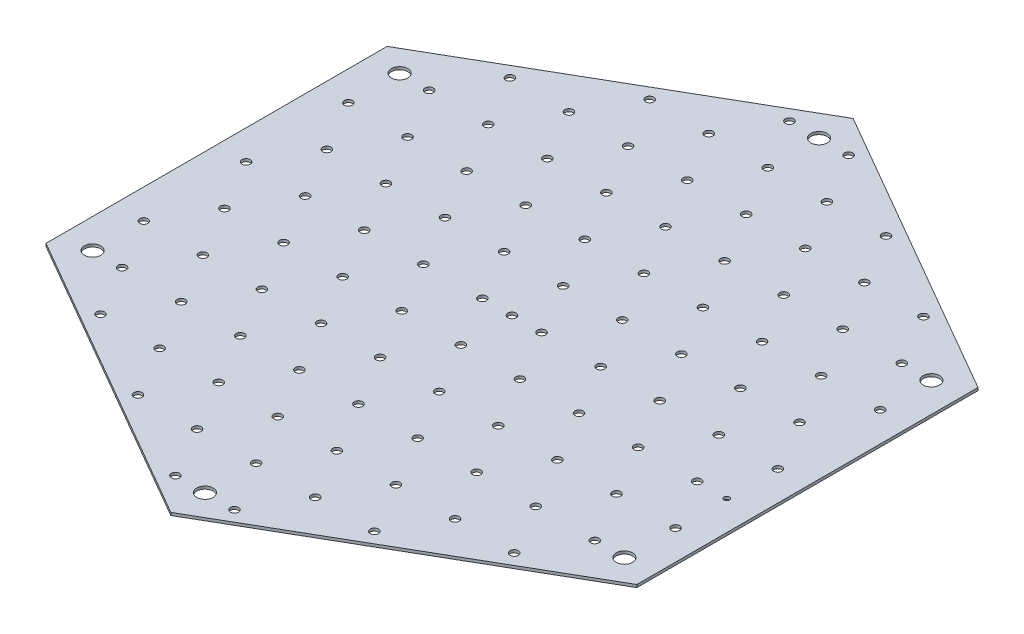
from build123d import *

# Parameters (mm, degrees)
BOSS_EXTRUDE1_DEPTH   = 0.5
SKETCH2_R             = 0.75
CUT_EXTRUDE1_DEPTH    = 83.681240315
BOSS_EXTRUDE2_DEPTH   = 0.5
BOSS_EXTRUDE3_DEPTH   = 0.5
BOSS_EXTRUDE4_DEPTH   = 0.5
SKETCH4_R             = 1.5
CUT_EXTRUDE3_DEPTH    = 83.681240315
SKETCH8_R             = 0.75
CUT_EXTRUDE4_DEPTH    = 83.681240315
SKETCH9_R             = 0.75
CUT_EXTRUDE5_DEPTH    = 83.681240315
SKETCH10_R            = 0.75
CUT_EXTRUDE6_DEPTH    = 83.681240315
SKETCH11_R            = 0.75
CUT_EXTRUDE7_DEPTH    = 83.681240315
SKETCH12_R            = 0.75
CUT_EXTRUDE8_DEPTH    = 83.681240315
SKETCH13_R            = 0.75
CUT_EXTRUDE9_DEPTH    = 83.681240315
SKETCH14_R            = 0.75
CUT_EXTRUDE10_DEPTH   = 83.681240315
SKETCH15_R            = 0.75
CUT_EXTRUDE11_DEPTH   = 83.681240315
SKETCH16_R            = 0.75
CUT_EXTRUDE12_DEPTH   = 83.681240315
SKETCH17_R            = 0.75
CUT_EXTRUDE13_DEPTH   = 83.681240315
LPATTERN3_COUNT       = 5
LPATTERN3_PITCH       = 10.8253
LPATTERN3_COL_COUNT   = 6
LPATTERN3_COL_PITCH   = 10.8253
LPATTERN4_COUNT       = 6
LPATTERN4_PITCH       = 10.8253
LPATTERN4_COL_COUNT   = 5
LPATTERN4_COL_PITCH   = 10.8253
LPATTERN5_COUNT       = 4
LPATTERN5_PITCH       = 10.8253
LPATTERN5_COL_COUNT   = 7
LPATTERN5_COL_PITCH   = 10.8253
LPATTERN6_COUNT       = 3
LPATTERN6_PITCH       = 10.8253
LPATTERN6_COL_COUNT   = 7
LPATTERN6_COL_PITCH   = 10.8253
LPATTERN7_COUNT       = 6
LPATTERN7_PITCH       = 10.8253
LPATTERN8_COUNT       = 5
LPATTERN8_PITCH       = 10.8253
LPATTERN9_COUNT       = 5
LPATTERN9_PITCH       = 10.8253
LPATTERN9_COL_COUNT   = 2
LPATTERN9_COL_PITCH   = 10.8253
LPATTERN10_COUNT      = 4
LPATTERN10_PITCH      = 10.8253
LPATTERN10_COL_COUNT  = 3
LPATTERN10_COL_PITCH  = 10.8253
LPATTERN11_COUNT      = 4
LPATTERN11_PITCH      = 10.8253
LPATTERN11_COL_COUNT  = 3
LPATTERN11_COL_PITCH  = 10.8253
LPATTERN12_COUNT      = 5
LPATTERN12_PITCH      = 10.8253
LPATTERN13_COUNT      = 6
LPATTERN13_PITCH      = 10.8253
LPATTERN14_COUNT      = 6
LPATTERN14_PITCH      = 10.8253
LPATTERN14_COUNT_DIR2 = 5
LPATTERN14_PITCH_DIR2 = 10.8253
LPATTERN15_COUNT      = 7
LPATTERN15_PITCH      = 10.8253
LPATTERN15_COUNT_DIR2 = 4
LPATTERN15_PITCH_DIR2 = 10.8253
LPATTERN16_COUNT      = 7
LPATTERN16_PITCH      = 10.8253
LPATTERN16_COUNT_DIR2 = 3
LPATTERN16_PITCH_DIR2 = 10.8253
LPATTERN17_COUNT      = 6
LPATTERN17_PITCH      = 10.8253
LPATTERN18_COUNT      = 5
LPATTERN18_PITCH      = 10.8253
LPATTERN19_COUNT      = 4
LPATTERN19_PITCH      = 10.8253
LPATTERN20_COUNT      = 3
LPATTERN20_PITCH      = 10.8253
SKETCH18_R            = 0.5
CUT_EXTRUDE14_DEPTH   = 83.681240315


with BuildPart() as part:
    # Sketch1 → Boss-Extrude1 (new body)
    with BuildSketch(Plane(origin=(0, 0, 0), x_dir=(1, 0, 0), z_dir=(0, 1, 0))):
        Polygon((0, 62.5), (-54.126587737, 31.25), (-54.126587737, -31.25), (0, -62.5), (54.126587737, -31.25), (54.126587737, 31.25), align=None)
    extrude(amount=BOSS_EXTRUDE1_DEPTH)

    # Sketch2 → Cut-Extrude1 (cut, through all)
    with BuildSketch(Plane(origin=(0, 0.5, 0), x_dir=(1, 0, 0), z_dir=(0, 1, 0))):
        with Locations(Location((0, 0, 0), (0, 0, 270))):
            Circle(SKETCH2_R)
    extrude(amount=-CUT_EXTRUDE1_DEPTH, mode=Mode.SUBTRACT)

    # Sketch5 → Boss-Extrude2 (add)
    with BuildSketch(Plane(origin=(0, 0.5, 0), x_dir=(1, 0, 0), z_dir=(0, 1, 0))):
        Polygon((-54.126587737, 26.862137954), (3.8, 60.306068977), (0, 62.5), (-54.126587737, 31.25), align=None)
    extrude(amount=-BOSS_EXTRUDE2_DEPTH)

    # Sketch6 → Boss-Extrude3 (add)
    with BuildSketch(Plane(origin=(0, 0.5, 0), x_dir=(1, 0, 0), z_dir=(0, 1, 0))):
        Polygon((54.126587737, 31.25), (54.126587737, 26.862137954), (-3.8, 60.306068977), (0, 62.5), align=None)
    extrude(amount=-BOSS_EXTRUDE3_DEPTH)

    # Sketch7 → Boss-Extrude4 (add)
    with BuildSketch(Plane(origin=(0, 0.5, 0), x_dir=(1, 0, 0), z_dir=(0, 1, 0))):
        Polygon((-54.126587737, -31.25), (-54.126587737, -26.862137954), (0, -58.112137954), (54.126587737, -26.862137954), (54.126587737, -31.25), (0, -62.5), align=None)
    extrude(amount=-BOSS_EXTRUDE4_DEPTH)

    # Sketch4 → Cut-Extrude3 (cut, through all)
    with BuildSketch(Plane(origin=(0, 0.5, 0), x_dir=(1, 0, 0), z_dir=(0, 1, 0))):
        with Locations(Location((0, 56.253070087, 0), (0, 0, 270))):
            Circle(SKETCH4_R)
        with Locations(Location((-48.713928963, 28.125, 0), (0, 0, 270))):
            Circle(SKETCH4_R)
        with Locations(Location((-48.716587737, -28.126535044, 0), (0, 0, 270))):
            Circle(SKETCH4_R)
        with Locations(Location((0, -56.253070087, 0), (0, 0, 270))):
            Circle(SKETCH4_R)
        with Locations(Location((48.716587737, -28.126535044, 0), (0, 0, 270))):
            Circle(SKETCH4_R)
        with Locations(Location((48.716587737, 28.126535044, 0), (0, 0, 270))):
            Circle(SKETCH4_R)
    extrude(amount=-CUT_EXTRUDE3_DEPTH, mode=Mode.SUBTRACT)

    # Sketch8 → Cut-Extrude4 (cut, through all)
    with BuildSketch(Plane(origin=(0, 0.5, 0), x_dir=(1, 0, 0), z_dir=(0, 1, 0))):
        with Locations(Location((5.41265, 0, 0), (0, 0, 270))):
            Circle(SKETCH8_R)
    cut_extrude4 = extrude(amount=-CUT_EXTRUDE4_DEPTH, mode=Mode.SUBTRACT)

    # Sketch9 → Cut-Extrude5 (cut, through all)
    with BuildSketch(Plane(origin=(0, 0.5, 0), x_dir=(1, 0, 0), z_dir=(0, 1, 0))):
        with Locations(Location((16.23795, 0, 0), (0, 0, 270))):
            Circle(SKETCH9_R)
    cut_extrude5 = extrude(amount=-CUT_EXTRUDE5_DEPTH, mode=Mode.SUBTRACT)

    # Sketch10 → Cut-Extrude6 (cut, through all)
    with BuildSketch(Plane(origin=(0, 0.5, 0), x_dir=(1, 0, 0), z_dir=(0, 1, 0))):
        with Locations(Location((27.06325, 0, 0), (0, 0, 270))):
            Circle(SKETCH10_R)
    cut_extrude6 = extrude(amount=-CUT_EXTRUDE6_DEPTH, mode=Mode.SUBTRACT)

    # Sketch11 → Cut-Extrude7 (cut, through all)
    with BuildSketch(Plane(origin=(0, 0.5, 0), x_dir=(1, 0, 0), z_dir=(0, 1, 0))):
        with Locations(Location((37.88855, 0, 0), (0, 0, 270))):
            Circle(SKETCH11_R)
    cut_extrude7 = extrude(amount=-CUT_EXTRUDE7_DEPTH, mode=Mode.SUBTRACT)

    # Sketch12 → Cut-Extrude8 (cut, through all)
    with BuildSketch(Plane(origin=(0, 0.5, 0), x_dir=(1, 0, 0), z_dir=(0, 1, 0))):
        with Locations(Location((48.71385, 0, 0), (0, 0, 270))):
            Circle(SKETCH12_R)
    cut_extrude8 = extrude(amount=-CUT_EXTRUDE8_DEPTH, mode=Mode.SUBTRACT)

    # Sketch13 → Cut-Extrude9 (cut, through all)
    with BuildSketch(Plane(origin=(0, 0.5, 0), x_dir=(1, 0, 0), z_dir=(0, 1, 0))):
        with Locations(Location((-5.41265, 0, 0), (0, 0, 270))):
            Circle(SKETCH13_R)
    cut_extrude9 = extrude(amount=-CUT_EXTRUDE9_DEPTH, mode=Mode.SUBTRACT)

    # Sketch14 → Cut-Extrude10 (cut, through all)
    with BuildSketch(Plane(origin=(0, 0.5, 0), x_dir=(1, 0, 0), z_dir=(0, 1, 0))):
        with Locations(Location((-16.23795, 0, 0), (0, 0, 270))):
            Circle(SKETCH14_R)
    cut_extrude10 = extrude(amount=-CUT_EXTRUDE10_DEPTH, mode=Mode.SUBTRACT)

    # Sketch15 → Cut-Extrude11 (cut, through all)
    with BuildSketch(Plane(origin=(0, 0.5, 0), x_dir=(1, 0, 0), z_dir=(0, 1, 0))):
        with Locations(Location((-27.06325, 0, 0), (0, 0, 270))):
            Circle(SKETCH15_R)
    cut_extrude11 = extrude(amount=-CUT_EXTRUDE11_DEPTH, mode=Mode.SUBTRACT)

    # Sketch16 → Cut-Extrude12 (cut, through all)
    with BuildSketch(Plane(origin=(0, 0.5, 0), x_dir=(1, 0, 0), z_dir=(0, 1, 0))):
        with Locations(Location((-37.88855, 0, 0), (0, 0, 270))):
            Circle(SKETCH16_R)
    cut_extrude12 = extrude(amount=-CUT_EXTRUDE12_DEPTH, mode=Mode.SUBTRACT)

    # Sketch17 → Cut-Extrude13 (cut, through all)
    with BuildSketch(Plane(origin=(0, 0.5, 0), x_dir=(1, 0, 0), z_dir=(0, 1, 0))):
        with Locations(Location((-48.71385, 0, 0), (0, 0, 270))):
            Circle(SKETCH17_R)
    cut_extrude13 = extrude(amount=-CUT_EXTRUDE13_DEPTH, mode=Mode.SUBTRACT)

    # LPattern3: Cut-Extrude4 ×5
    with Locations(*[Vector(0.4999999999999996, 0, 0.8660254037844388) * (i * LPATTERN3_PITCH) for i in range(1, LPATTERN3_COUNT)]):
        add(cut_extrude4, mode=Mode.SUBTRACT)

    # LPattern3 col: Cut-Extrude4 ×6
    with Locations(*[Vector(-0.4999999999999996, 0, -0.8660254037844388) * (i * LPATTERN3_COL_PITCH) for i in range(1, LPATTERN3_COL_COUNT)]):
        add(cut_extrude4, mode=Mode.SUBTRACT)

    # LPattern4: Cut-Extrude5 ×6
    with Locations(*[Vector(-0.4999999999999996, 0, -0.8660254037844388) * (i * LPATTERN4_PITCH) for i in range(1, LPATTERN4_COUNT)]):
        add(cut_extrude5, mode=Mode.SUBTRACT)

    # LPattern4 col: Cut-Extrude5 ×5
    with Locations(*[Vector(0.4999999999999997, 0, 0.8660254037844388) * (i * LPATTERN4_COL_PITCH) for i in range(1, LPATTERN4_COL_COUNT)]):
        add(cut_extrude5, mode=Mode.SUBTRACT)

    # LPattern5: Cut-Extrude6 ×4
    with Locations(*[Vector(0.4999999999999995, 0, 0.8660254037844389) * (i * LPATTERN5_PITCH) for i in range(1, LPATTERN5_COUNT)]):
        add(cut_extrude6, mode=Mode.SUBTRACT)

    # LPattern5 col: Cut-Extrude6 ×7
    with Locations(*[Vector(-0.4999999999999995, 0, -0.8660254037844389) * (i * LPATTERN5_COL_PITCH) for i in range(1, LPATTERN5_COL_COUNT)]):
        add(cut_extrude6, mode=Mode.SUBTRACT)

    # LPattern6: Cut-Extrude7 ×3
    with Locations(*[Vector(0.4999999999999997, 0, 0.8660254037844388) * (i * LPATTERN6_PITCH) for i in range(1, LPATTERN6_COUNT)]):
        add(cut_extrude7, mode=Mode.SUBTRACT)

    # LPattern6 col: Cut-Extrude7 ×7
    with Locations(*[Vector(-0.4999999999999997, 0, -0.8660254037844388) * (i * LPATTERN6_COL_PITCH) for i in range(1, LPATTERN6_COL_COUNT)]):
        add(cut_extrude7, mode=Mode.SUBTRACT)

    # LPattern7: Cut-Extrude8 ×6
    with Locations(*[Vector(-0.4999999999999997, 0, -0.8660254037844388) * (i * LPATTERN7_PITCH) for i in range(1, LPATTERN7_COUNT)]):
        add(cut_extrude8, mode=Mode.SUBTRACT)

    # LPattern8: Cut-Extrude9 ×5
    with Locations(*[Vector(-0.4999999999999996, 0, 0.8660254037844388) * (i * LPATTERN8_PITCH) for i in range(1, LPATTERN8_COUNT)]):
        add(cut_extrude9, mode=Mode.SUBTRACT)

    # LPattern9: Cut-Extrude10 ×5
    with Locations(*[Vector(-0.4999999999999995, 0, 0.8660254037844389) * (i * LPATTERN9_PITCH) for i in range(1, LPATTERN9_COUNT)]):
        add(cut_extrude10, mode=Mode.SUBTRACT)

    # LPattern9 col: Cut-Extrude10 ×2
    with Locations(*[Vector(0.4999999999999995, 0, -0.8660254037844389) * (i * LPATTERN9_COL_PITCH) for i in range(1, LPATTERN9_COL_COUNT)]):
        add(cut_extrude10, mode=Mode.SUBTRACT)

    # LPattern10: Cut-Extrude11 ×4
    with Locations(*[Vector(-0.4999999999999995, 0, 0.8660254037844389) * (i * LPATTERN10_PITCH) for i in range(1, LPATTERN10_COUNT)]):
        add(cut_extrude11, mode=Mode.SUBTRACT)

    # LPattern10 col: Cut-Extrude11 ×3
    with Locations(*[Vector(0.4999999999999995, 0, -0.8660254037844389) * (i * LPATTERN10_COL_PITCH) for i in range(1, LPATTERN10_COL_COUNT)]):
        add(cut_extrude11, mode=Mode.SUBTRACT)

    # LPattern11: Cut-Extrude12 ×4
    with Locations(*[Vector(0.4999999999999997, 0, -0.8660254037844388) * (i * LPATTERN11_PITCH) for i in range(1, LPATTERN11_COUNT)]):
        add(cut_extrude12, mode=Mode.SUBTRACT)

    # LPattern11 col: Cut-Extrude12 ×3
    with Locations(*[Vector(-0.4999999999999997, 0, 0.8660254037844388) * (i * LPATTERN11_COL_PITCH) for i in range(1, LPATTERN11_COL_COUNT)]):
        add(cut_extrude12, mode=Mode.SUBTRACT)

    # LPattern12: Cut-Extrude13 ×5
    with Locations(*[Vector(0.4999999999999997, 0, -0.8660254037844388) * (i * LPATTERN12_PITCH) for i in range(1, LPATTERN12_COUNT)]):
        add(cut_extrude13, mode=Mode.SUBTRACT)

    # LPattern13: Cut-Extrude9 ×6
    with Locations(*[Vector(0.4999999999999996, 0, 0.8660254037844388) * (i * LPATTERN13_PITCH) for i in range(1, LPATTERN13_COUNT)]):
        add(cut_extrude9, mode=Mode.SUBTRACT)

    # LPattern14: Cut-Extrude10 6 × 5
    with Locations(*[Vector(0.4999999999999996, 0, 0.8660254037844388) * (i * LPATTERN14_PITCH) + Vector(-0.4999999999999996, 0, -0.8660254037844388) * (j * LPATTERN14_PITCH_DIR2) for i in range(LPATTERN14_COUNT) for j in range(LPATTERN14_COUNT_DIR2) if (i, j) != (0, 0)]):
        add(cut_extrude10, mode=Mode.SUBTRACT)

    # LPattern15: Cut-Extrude11 7 × 4
    with Locations(*[Vector(0.4999999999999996, 0, 0.8660254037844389) * (i * LPATTERN15_PITCH) + Vector(-0.4999999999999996, 0, -0.8660254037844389) * (j * LPATTERN15_PITCH_DIR2) for i in range(LPATTERN15_COUNT) for j in range(LPATTERN15_COUNT_DIR2) if (i, j) != (0, 0)]):
        add(cut_extrude11, mode=Mode.SUBTRACT)

    # LPattern16: Cut-Extrude12 7 × 3
    with Locations(*[Vector(0.4999999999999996, 0, 0.8660254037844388) * (i * LPATTERN16_PITCH) + Vector(-0.4999999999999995, 0, -0.8660254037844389) * (j * LPATTERN16_PITCH_DIR2) for i in range(LPATTERN16_COUNT) for j in range(LPATTERN16_COUNT_DIR2) if (i, j) != (0, 0)]):
        add(cut_extrude12, mode=Mode.SUBTRACT)

    # LPattern17: Cut-Extrude13 ×6
    with Locations(*[Vector(0.49999999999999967, 0, 0.8660254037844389) * (i * LPATTERN17_PITCH) for i in range(1, LPATTERN17_COUNT)]):
        add(cut_extrude13, mode=Mode.SUBTRACT)

    # LPattern18: Cut-Extrude5 ×5
    with Locations(*[Vector(0.4999999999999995, 0, -0.8660254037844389) * (i * LPATTERN18_PITCH) for i in range(1, LPATTERN18_COUNT)]):
        add(cut_extrude5, mode=Mode.SUBTRACT)

    # LPattern19: Cut-Extrude6 ×4
    with Locations(*[Vector(0.4999999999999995, 0, -0.866025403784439) * (i * LPATTERN19_PITCH) for i in range(1, LPATTERN19_COUNT)]):
        add(cut_extrude6, mode=Mode.SUBTRACT)

    # LPattern20: Cut-Extrude7 ×3
    with Locations(*[Vector(0.4999999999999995, 0, -0.8660254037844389) * (i * LPATTERN20_PITCH) for i in range(1, LPATTERN20_COUNT)]):
        add(cut_extrude7, mode=Mode.SUBTRACT)

    # Sketch18 → Cut-Extrude14 (cut, through all)
    with BuildSketch(Plane(origin=(0, 0.5, 0), x_dir=(1, 0, 0), z_dir=(0, 1, 0))):
        with Locations(Location((48.71385, -9.374984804, 0), (0, 0, 270))):
            Circle(SKETCH18_R)
    extrude(amount=-CUT_EXTRUDE14_DEPTH, mode=Mode.SUBTRACT)


solid = part.part
